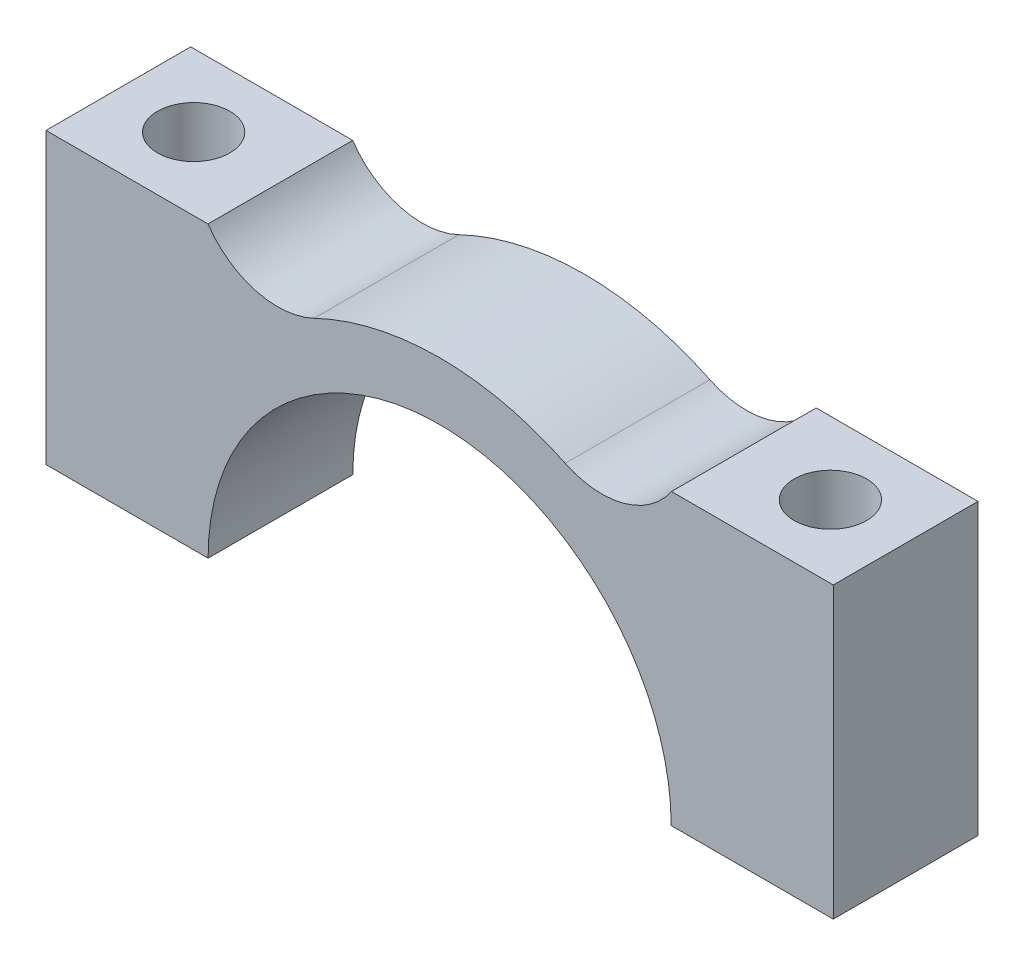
from build123d import *

# Parameters (mm, degrees)
BOSS_EXTRUDE1_DEPTH = 5
SKETCH3_R           = 1.25
CUT_EXTRUDE1_DEPTH  = 10


with BuildPart() as part:
    # Sketch2 → Boss-Extrude1 (new body)
    with BuildSketch(Plane.XY):
        with BuildLine():
            ThreePointArc((-8, 0), (0, 8), (8, 0))
            Line((8, 0), (13.6, 0))
            Line((13.6, 0), (13.6, 10))
            Line((13.6, 10), (8.008871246, 10))
            ThreePointArc((8.008871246, 10), (6.357463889, 8.822466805), (4.337930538, 9.01012534))
            ThreePointArc((4.337930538, 9.01012534), (0.001186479, 9.99999993), (-4.335792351, 9.011154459))
            ThreePointArc((-4.335792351, 9.011154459), (-6.353531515, 8.82385013), (-8.003690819, 10))
            Line((-8.003690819, 10), (-13.6, 10))
            Line((-13.6, 10), (-13.6, 0))
            Line((-13.6, 0), (-8, 0))
        make_face()
    extrude(amount=BOSS_EXTRUDE1_DEPTH)

    # Sketch3 → Cut-Extrude1 (cut)
    with BuildSketch(Plane(origin=(0, 10, 0), x_dir=(1, 0, 0), z_dir=(0, 1, 0))):
        with Locations(Location((-10.998930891, -2.5, 0), (0, 0, 270))):
            Circle(SKETCH3_R)
        with Locations(Location((11.001069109, -2.5, 0), (0, 0, 270))):
            Circle(SKETCH3_R)
    extrude(amount=-CUT_EXTRUDE1_DEPTH, mode=Mode.SUBTRACT)


solid = part.part
